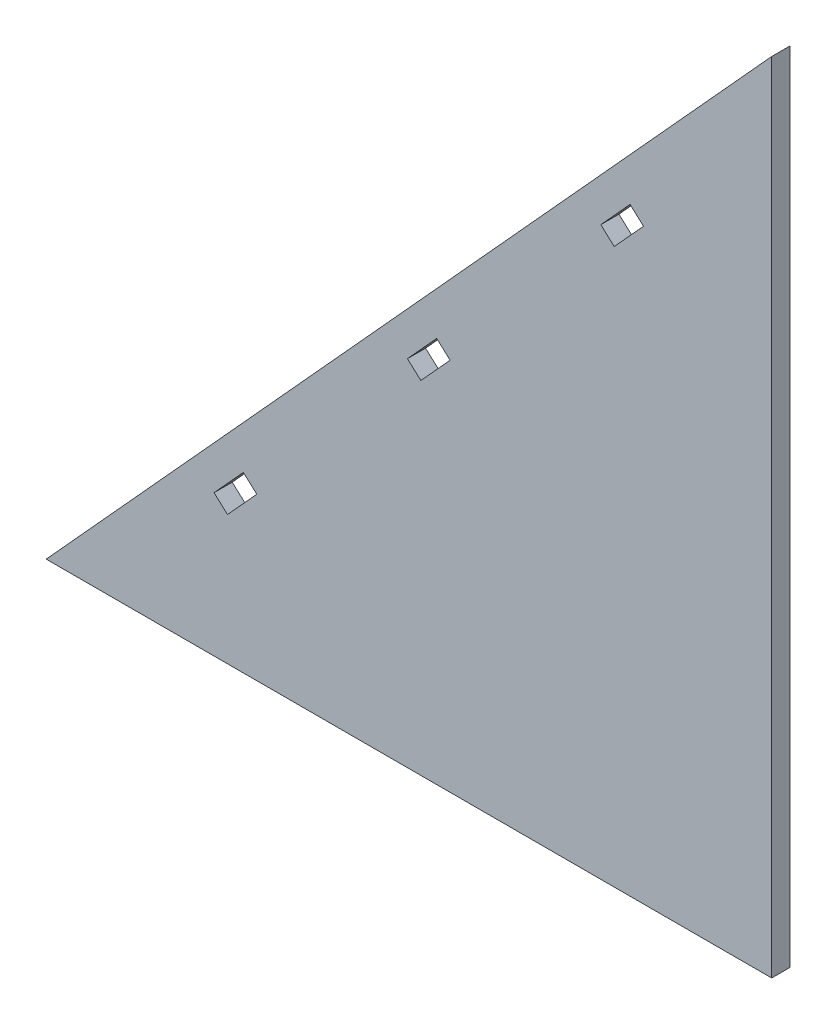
ISO-10303-21;
HEADER;
FILE_DESCRIPTION(('STEP AP214'),'2;1');
FILE_NAME('part.step','',(''),(''),'','','');
FILE_SCHEMA(('AUTOMOTIVE_DESIGN { 1 0 10303 214 1 1 1 1 }'));
ENDSEC;
DATA;
#1=APPLICATION_CONTEXT('core data for automotive mechanical design processes');
#2=APPLICATION_PROTOCOL_DEFINITION('international standard','automotive_design',2000,#1);
#3=PRODUCT_CONTEXT('',#1,'mechanical');
#4=PRODUCT('Part','Part','',(#3));
#5=PRODUCT_RELATED_PRODUCT_CATEGORY('part','',(#4));
#6=PRODUCT_DEFINITION_FORMATION('','',#4);
#7=PRODUCT_DEFINITION_CONTEXT('part definition',#1,'design');
#8=PRODUCT_DEFINITION('design','',#6,#7);
#9=PRODUCT_DEFINITION_SHAPE('','',#8);
#10=(LENGTH_UNIT() NAMED_UNIT(*) SI_UNIT(.MILLI.,.METRE.));
#11=(NAMED_UNIT(*) PLANE_ANGLE_UNIT() SI_UNIT($,.RADIAN.));
#12=(NAMED_UNIT(*) SI_UNIT($,.STERADIAN.) SOLID_ANGLE_UNIT());
#13=UNCERTAINTY_MEASURE_WITH_UNIT(LENGTH_MEASURE(1.E-05),#10,'distance_accuracy_value','');
#14=(GEOMETRIC_REPRESENTATION_CONTEXT(3) GLOBAL_UNCERTAINTY_ASSIGNED_CONTEXT((#13)) GLOBAL_UNIT_ASSIGNED_CONTEXT((#10,
#11,#12)) REPRESENTATION_CONTEXT('',''));
#15=CARTESIAN_POINT('',(0.,0.,0.));
#16=DIRECTION('',(0.,0.,1.));
#17=DIRECTION('',(1.,0.,0.));
#18=AXIS2_PLACEMENT_3D('',#15,#16,#17);
#19=CARTESIAN_POINT('',(0.,0.,2.5));
#20=DIRECTION('',(0.,0.,1.));
#21=DIRECTION('',(1.,0.,0.));
#22=AXIS2_PLACEMENT_3D('',#19,#20,#21);
#23=PLANE('',#22);
#24=DIRECTION('',(-0.672672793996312,-0.739940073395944,0.));
#25=VECTOR('',#24,1.);
#26=CARTESIAN_POINT('',(99.2546760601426,97.8127892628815,2.5));
#27=LINE('',#26,#25);
#28=CARTESIAN_POINT('',(99.2546760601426,97.8127892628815,2.5));
#29=VERTEX_POINT('',#28);
#30=CARTESIAN_POINT('',(-0.745323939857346,-12.1872107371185,2.5));
#31=VERTEX_POINT('',#30);
#32=EDGE_CURVE('E240',#29,#31,#27,.T.);
#33=ORIENTED_EDGE('',*,*,#32,.T.);
#34=DIRECTION('',(1.,0.,0.));
#35=VECTOR('',#34,1.);
#36=CARTESIAN_POINT('',(-0.745323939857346,-12.1872107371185,2.5));
#37=LINE('',#36,#35);
#38=CARTESIAN_POINT('',(99.2546760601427,-12.1872107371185,2.5));
#39=VERTEX_POINT('',#38);
#40=EDGE_CURVE('E243',#31,#39,#37,.T.);
#41=ORIENTED_EDGE('',*,*,#40,.T.);
#42=DIRECTION('',(0.,1.,0.));
#43=VECTOR('',#42,1.);
#44=CARTESIAN_POINT('',(99.2546760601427,-12.1872107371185,2.5));
#45=LINE('',#44,#43);
#46=EDGE_CURVE('E246',#39,#29,#45,.T.);
#47=ORIENTED_EDGE('',*,*,#46,.T.);
#48=EDGE_LOOP('',(#33,#41,#47));
#49=FACE_BOUND('',#48,.T.);
#50=DIRECTION('',(0.672672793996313,0.739940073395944,0.));
#51=VECTOR('',#50,1.);
#52=CARTESIAN_POINT('',(77.5494150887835,64.2740575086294,2.5));
#53=LINE('',#52,#51);
#54=CARTESIAN_POINT('',(77.5494150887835,64.2740575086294,2.5));
#55=VERTEX_POINT('',#54);
#56=CARTESIAN_POINT('',(81.5854518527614,68.713697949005,2.5));
#57=VERTEX_POINT('',#56);
#58=EDGE_CURVE('E211',#55,#57,#53,.T.);
#59=ORIENTED_EDGE('',*,*,#58,.F.);
#60=DIRECTION('',(0.739940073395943,-0.672672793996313,0.));
#61=VECTOR('',#60,1.);
#62=CARTESIAN_POINT('',(75.6995649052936,65.9557394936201,2.5));
#63=LINE('',#62,#61);
#64=CARTESIAN_POINT('',(75.6995649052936,65.9557394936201,2.5));
#65=VERTEX_POINT('',#64);
#66=EDGE_CURVE('E209',#65,#55,#63,.T.);
#67=ORIENTED_EDGE('',*,*,#66,.F.);
#68=DIRECTION('',(-0.672672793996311,-0.739940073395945,0.));
#69=VECTOR('',#68,1.);
#70=CARTESIAN_POINT('',(75.6995649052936,65.9557394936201,2.5));
#71=LINE('',#70,#69);
#72=CARTESIAN_POINT('',(79.7356016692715,70.3953799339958,2.5));
#73=VERTEX_POINT('',#72);
#74=EDGE_CURVE('E217',#73,#65,#71,.T.);
#75=ORIENTED_EDGE('',*,*,#74,.F.);
#76=DIRECTION('',(-0.73994007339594,0.672672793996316,0.));
#77=VECTOR('',#76,1.);
#78=CARTESIAN_POINT('',(79.7356016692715,70.3953799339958,2.5));
#79=LINE('',#78,#77);
#80=EDGE_CURVE('E214',#57,#73,#79,.T.);
#81=ORIENTED_EDGE('',*,*,#80,.F.);
#82=EDGE_LOOP('',(#59,#67,#75,#81));
#83=FACE_BOUND('',#82,.T.);
#84=DIRECTION('',(0.672672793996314,0.739940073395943,0.));
#85=VECTOR('',#84,1.);
#86=CARTESIAN_POINT('',(50.8988303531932,34.9546218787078,2.5));
#87=LINE('',#86,#85);
#88=CARTESIAN_POINT('',(50.8988303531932,34.9546218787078,2.5));
#89=VERTEX_POINT('',#88);
#90=CARTESIAN_POINT('',(54.9348671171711,39.3942623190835,2.5));
#91=VERTEX_POINT('',#90);
#92=EDGE_CURVE('E180',#89,#91,#87,.T.);
#93=ORIENTED_EDGE('',*,*,#92,.F.);
#94=DIRECTION('',(0.739940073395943,-0.672672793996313,0.));
#95=VECTOR('',#94,1.);
#96=CARTESIAN_POINT('',(49.0489801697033,36.6363038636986,2.5));
#97=LINE('',#96,#95);
#98=CARTESIAN_POINT('',(49.0489801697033,36.6363038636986,2.5));
#99=VERTEX_POINT('',#98);
#100=EDGE_CURVE('E178',#99,#89,#97,.T.);
#101=ORIENTED_EDGE('',*,*,#100,.F.);
#102=DIRECTION('',(-0.672672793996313,-0.739940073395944,0.));
#103=VECTOR('',#102,1.);
#104=CARTESIAN_POINT('',(49.0489801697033,36.6363038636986,2.5));
#105=LINE('',#104,#103);
#106=CARTESIAN_POINT('',(53.0850169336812,41.0759443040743,2.5));
#107=VERTEX_POINT('',#106);
#108=EDGE_CURVE('E186',#107,#99,#105,.T.);
#109=ORIENTED_EDGE('',*,*,#108,.F.);
#110=DIRECTION('',(-0.739940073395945,0.672672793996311,0.));
#111=VECTOR('',#110,1.);
#112=CARTESIAN_POINT('',(53.0850169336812,41.0759443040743,2.5));
#113=LINE('',#112,#111);
#114=EDGE_CURVE('E183',#91,#107,#113,.T.);
#115=ORIENTED_EDGE('',*,*,#114,.F.);
#116=EDGE_LOOP('',(#93,#101,#109,#115));
#117=FACE_BOUND('',#116,.T.);
#118=DIRECTION('',(0.672672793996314,0.739940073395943,0.));
#119=VECTOR('',#118,1.);
#120=CARTESIAN_POINT('',(24.2482456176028,5.6351862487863,2.5));
#121=LINE('',#120,#119);
#122=CARTESIAN_POINT('',(24.2482456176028,5.6351862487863,2.5));
#123=VERTEX_POINT('',#122);
#124=CARTESIAN_POINT('',(28.2842823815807,10.074826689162,2.5));
#125=VERTEX_POINT('',#124);
#126=EDGE_CURVE('E150',#123,#125,#121,.T.);
#127=ORIENTED_EDGE('',*,*,#126,.F.);
#128=DIRECTION('',(0.739940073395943,-0.672672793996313,0.));
#129=VECTOR('',#128,1.);
#130=CARTESIAN_POINT('',(22.398395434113,7.31686823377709,2.5));
#131=LINE('',#130,#129);
#132=CARTESIAN_POINT('',(22.398395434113,7.31686823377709,2.5));
#133=VERTEX_POINT('',#132);
#134=EDGE_CURVE('E142',#133,#123,#131,.T.);
#135=ORIENTED_EDGE('',*,*,#134,.F.);
#136=DIRECTION('',(-0.672672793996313,-0.739940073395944,0.));
#137=VECTOR('',#136,1.);
#138=CARTESIAN_POINT('',(22.398395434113,7.31686823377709,2.5));
#139=LINE('',#138,#137);
#140=CARTESIAN_POINT('',(26.4344321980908,11.7565086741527,2.5));
#141=VERTEX_POINT('',#140);
#142=EDGE_CURVE('E164',#141,#133,#139,.T.);
#143=ORIENTED_EDGE('',*,*,#142,.F.);
#144=DIRECTION('',(-0.739940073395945,0.672672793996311,0.));
#145=VECTOR('',#144,1.);
#146=CARTESIAN_POINT('',(26.4344321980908,11.7565086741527,2.5));
#147=LINE('',#146,#145);
#148=EDGE_CURVE('E162',#125,#141,#147,.T.);
#149=ORIENTED_EDGE('',*,*,#148,.F.);
#150=EDGE_LOOP('',(#127,#135,#143,#149));
#151=FACE_BOUND('',#150,.T.);
#152=ADVANCED_FACE('F35',(#49,#83,#117,#151),#23,.T.);
#153=CARTESIAN_POINT('',(0.,0.,0.));
#154=DIRECTION('',(0.,0.,1.));
#155=DIRECTION('',(1.,0.,0.));
#156=AXIS2_PLACEMENT_3D('',#153,#154,#155);
#157=PLANE('',#156);
#158=DIRECTION('',(0.739940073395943,-0.672672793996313,0.));
#159=VECTOR('',#158,1.);
#160=CARTESIAN_POINT('',(49.0489801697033,36.6363038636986,0.));
#161=LINE('',#160,#159);
#162=CARTESIAN_POINT('',(49.0489801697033,36.6363038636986,0.));
#163=VERTEX_POINT('',#162);
#164=CARTESIAN_POINT('',(50.8988303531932,34.9546218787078,0.));
#165=VERTEX_POINT('',#164);
#166=EDGE_CURVE('E158',#163,#165,#161,.T.);
#167=ORIENTED_EDGE('',*,*,#166,.T.);
#168=DIRECTION('',(0.672672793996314,0.739940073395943,0.));
#169=VECTOR('',#168,1.);
#170=CARTESIAN_POINT('',(50.8988303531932,34.9546218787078,0.));
#171=LINE('',#170,#169);
#172=CARTESIAN_POINT('',(54.9348671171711,39.3942623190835,0.));
#173=VERTEX_POINT('',#172);
#174=EDGE_CURVE('E191',#165,#173,#171,.T.);
#175=ORIENTED_EDGE('',*,*,#174,.T.);
#176=DIRECTION('',(-0.739940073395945,0.672672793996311,0.));
#177=VECTOR('',#176,1.);
#178=CARTESIAN_POINT('',(53.0850169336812,41.0759443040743,0.));
#179=LINE('',#178,#177);
#180=CARTESIAN_POINT('',(53.0850169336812,41.0759443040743,0.));
#181=VERTEX_POINT('',#180);
#182=EDGE_CURVE('E194',#173,#181,#179,.T.);
#183=ORIENTED_EDGE('',*,*,#182,.T.);
#184=DIRECTION('',(-0.672672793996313,-0.739940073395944,0.));
#185=VECTOR('',#184,1.);
#186=CARTESIAN_POINT('',(49.0489801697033,36.6363038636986,0.));
#187=LINE('',#186,#185);
#188=EDGE_CURVE('E181',#181,#163,#187,.T.);
#189=ORIENTED_EDGE('',*,*,#188,.T.);
#190=EDGE_LOOP('',(#167,#175,#183,#189));
#191=FACE_BOUND('',#190,.T.);
#192=DIRECTION('',(-0.672672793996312,-0.739940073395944,0.));
#193=VECTOR('',#192,1.);
#194=CARTESIAN_POINT('',(99.2546760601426,97.8127892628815,0.));
#195=LINE('',#194,#193);
#196=CARTESIAN_POINT('',(99.2546760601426,97.8127892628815,0.));
#197=VERTEX_POINT('',#196);
#198=CARTESIAN_POINT('',(-0.745323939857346,-12.1872107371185,0.));
#199=VERTEX_POINT('',#198);
#200=EDGE_CURVE('E239',#197,#199,#195,.T.);
#201=ORIENTED_EDGE('',*,*,#200,.F.);
#202=DIRECTION('',(0.,1.,0.));
#203=VECTOR('',#202,1.);
#204=CARTESIAN_POINT('',(99.2546760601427,-12.1872107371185,0.));
#205=LINE('',#204,#203);
#206=CARTESIAN_POINT('',(99.2546760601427,-12.1872107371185,0.));
#207=VERTEX_POINT('',#206);
#208=EDGE_CURVE('E244',#207,#197,#205,.T.);
#209=ORIENTED_EDGE('',*,*,#208,.F.);
#210=DIRECTION('',(1.,0.,0.));
#211=VECTOR('',#210,1.);
#212=CARTESIAN_POINT('',(-0.745323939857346,-12.1872107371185,0.));
#213=LINE('',#212,#211);
#214=EDGE_CURVE('E251',#199,#207,#213,.T.);
#215=ORIENTED_EDGE('',*,*,#214,.F.);
#216=EDGE_LOOP('',(#201,#209,#215));
#217=FACE_BOUND('',#216,.T.);
#218=DIRECTION('',(0.739940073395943,-0.672672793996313,0.));
#219=VECTOR('',#218,1.);
#220=CARTESIAN_POINT('',(75.6995649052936,65.9557394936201,0.));
#221=LINE('',#220,#219);
#222=CARTESIAN_POINT('',(75.6995649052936,65.9557394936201,0.));
#223=VERTEX_POINT('',#222);
#224=CARTESIAN_POINT('',(77.5494150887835,64.2740575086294,0.));
#225=VERTEX_POINT('',#224);
#226=EDGE_CURVE('E208',#223,#225,#221,.T.);
#227=ORIENTED_EDGE('',*,*,#226,.T.);
#228=DIRECTION('',(0.672672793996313,0.739940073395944,0.));
#229=VECTOR('',#228,1.);
#230=CARTESIAN_POINT('',(77.5494150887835,64.2740575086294,0.));
#231=LINE('',#230,#229);
#232=CARTESIAN_POINT('',(81.5854518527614,68.713697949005,0.));
#233=VERTEX_POINT('',#232);
#234=EDGE_CURVE('E222',#225,#233,#231,.T.);
#235=ORIENTED_EDGE('',*,*,#234,.T.);
#236=DIRECTION('',(-0.73994007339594,0.672672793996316,0.));
#237=VECTOR('',#236,1.);
#238=CARTESIAN_POINT('',(79.7356016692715,70.3953799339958,0.));
#239=LINE('',#238,#237);
#240=CARTESIAN_POINT('',(79.7356016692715,70.3953799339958,0.));
#241=VERTEX_POINT('',#240);
#242=EDGE_CURVE('E225',#233,#241,#239,.T.);
#243=ORIENTED_EDGE('',*,*,#242,.T.);
#244=DIRECTION('',(-0.672672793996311,-0.739940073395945,0.));
#245=VECTOR('',#244,1.);
#246=CARTESIAN_POINT('',(75.6995649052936,65.9557394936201,0.));
#247=LINE('',#246,#245);
#248=EDGE_CURVE('E212',#241,#223,#247,.T.);
#249=ORIENTED_EDGE('',*,*,#248,.T.);
#250=EDGE_LOOP('',(#227,#235,#243,#249));
#251=FACE_BOUND('',#250,.T.);
#252=DIRECTION('',(0.739940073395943,-0.672672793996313,0.));
#253=VECTOR('',#252,1.);
#254=CARTESIAN_POINT('',(22.398395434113,7.31686823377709,0.));
#255=LINE('',#254,#253);
#256=CARTESIAN_POINT('',(22.398395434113,7.31686823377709,0.));
#257=VERTEX_POINT('',#256);
#258=CARTESIAN_POINT('',(24.2482456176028,5.6351862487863,0.));
#259=VERTEX_POINT('',#258);
#260=EDGE_CURVE('E58',#257,#259,#255,.T.);
#261=ORIENTED_EDGE('',*,*,#260,.T.);
#262=DIRECTION('',(0.672672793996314,0.739940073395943,0.));
#263=VECTOR('',#262,1.);
#264=CARTESIAN_POINT('',(24.2482456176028,5.6351862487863,0.));
#265=LINE('',#264,#263);
#266=CARTESIAN_POINT('',(28.2842823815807,10.074826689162,0.));
#267=VERTEX_POINT('',#266);
#268=EDGE_CURVE('E157',#259,#267,#265,.T.);
#269=ORIENTED_EDGE('',*,*,#268,.T.);
#270=DIRECTION('',(-0.739940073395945,0.672672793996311,0.));
#271=VECTOR('',#270,1.);
#272=CARTESIAN_POINT('',(26.4344321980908,11.7565086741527,0.));
#273=LINE('',#272,#271);
#274=CARTESIAN_POINT('',(26.4344321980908,11.7565086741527,0.));
#275=VERTEX_POINT('',#274);
#276=EDGE_CURVE('E170',#267,#275,#273,.T.);
#277=ORIENTED_EDGE('',*,*,#276,.T.);
#278=DIRECTION('',(-0.672672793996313,-0.739940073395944,0.));
#279=VECTOR('',#278,1.);
#280=CARTESIAN_POINT('',(22.398395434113,7.31686823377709,0.));
#281=LINE('',#280,#279);
#282=EDGE_CURVE('E151',#275,#257,#281,.T.);
#283=ORIENTED_EDGE('',*,*,#282,.T.);
#284=EDGE_LOOP('',(#261,#269,#277,#283));
#285=FACE_BOUND('',#284,.T.);
#286=ADVANCED_FACE('F265',(#191,#217,#251,#285),#157,.F.);
#287=CARTESIAN_POINT('',(99.2546760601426,97.8127892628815,2.5));
#288=DIRECTION('',(0.739940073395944,-0.672672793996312,0.));
#289=DIRECTION('',(0.672672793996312,0.739940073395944,0.));
#290=AXIS2_PLACEMENT_3D('',#287,#288,#289);
#291=PLANE('',#290);
#292=ORIENTED_EDGE('',*,*,#200,.T.);
#293=DIRECTION('',(0.,0.,-1.));
#294=VECTOR('',#293,1.);
#295=CARTESIAN_POINT('',(-0.745323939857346,-12.1872107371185,2.5));
#296=LINE('',#295,#294);
#297=EDGE_CURVE('E11',#31,#199,#296,.T.);
#298=ORIENTED_EDGE('',*,*,#297,.F.);
#299=ORIENTED_EDGE('',*,*,#32,.F.);
#300=DIRECTION('',(0.,0.,-1.));
#301=VECTOR('',#300,1.);
#302=CARTESIAN_POINT('',(99.2546760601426,97.8127892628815,2.5));
#303=LINE('',#302,#301);
#304=EDGE_CURVE('E248',#29,#197,#303,.T.);
#305=ORIENTED_EDGE('',*,*,#304,.T.);
#306=EDGE_LOOP('',(#292,#298,#299,#305));
#307=FACE_BOUND('',#306,.T.);
#308=ADVANCED_FACE('F37',(#307),#291,.F.);
#309=CARTESIAN_POINT('',(-0.745323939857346,-12.1872107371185,2.5));
#310=DIRECTION('',(0.,1.,0.));
#311=DIRECTION('',(-1.,0.,0.));
#312=AXIS2_PLACEMENT_3D('',#309,#310,#311);
#313=PLANE('',#312);
#314=ORIENTED_EDGE('',*,*,#214,.T.);
#315=DIRECTION('',(0.,0.,-1.));
#316=VECTOR('',#315,1.);
#317=CARTESIAN_POINT('',(99.2546760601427,-12.1872107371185,2.5));
#318=LINE('',#317,#316);
#319=EDGE_CURVE('E43',#39,#207,#318,.T.);
#320=ORIENTED_EDGE('',*,*,#319,.F.);
#321=ORIENTED_EDGE('',*,*,#40,.F.);
#322=ORIENTED_EDGE('',*,*,#297,.T.);
#323=EDGE_LOOP('',(#314,#320,#321,#322));
#324=FACE_BOUND('',#323,.T.);
#325=ADVANCED_FACE('F272',(#324),#313,.F.);
#326=CARTESIAN_POINT('',(99.2546760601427,-12.1872107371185,2.5));
#327=DIRECTION('',(-1.,0.,0.));
#328=DIRECTION('',(0.,-1.,0.));
#329=AXIS2_PLACEMENT_3D('',#326,#327,#328);
#330=PLANE('',#329);
#331=ORIENTED_EDGE('',*,*,#208,.T.);
#332=ORIENTED_EDGE('',*,*,#304,.F.);
#333=ORIENTED_EDGE('',*,*,#46,.F.);
#334=ORIENTED_EDGE('',*,*,#319,.T.);
#335=EDGE_LOOP('',(#331,#332,#333,#334));
#336=FACE_BOUND('',#335,.T.);
#337=ADVANCED_FACE('F260',(#336),#330,.F.);
#338=CARTESIAN_POINT('',(75.6995649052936,65.9557394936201,2.5));
#339=DIRECTION('',(0.672672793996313,0.739940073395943,0.));
#340=DIRECTION('',(-0.739940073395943,0.672672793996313,0.));
#341=AXIS2_PLACEMENT_3D('',#338,#339,#340);
#342=PLANE('',#341);
#343=ORIENTED_EDGE('',*,*,#226,.F.);
#344=DIRECTION('',(0.,0.,-1.));
#345=VECTOR('',#344,1.);
#346=CARTESIAN_POINT('',(75.6995649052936,65.9557394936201,2.5));
#347=LINE('',#346,#345);
#348=EDGE_CURVE('E219',#65,#223,#347,.T.);
#349=ORIENTED_EDGE('',*,*,#348,.F.);
#350=ORIENTED_EDGE('',*,*,#66,.T.);
#351=DIRECTION('',(0.,0.,-1.));
#352=VECTOR('',#351,1.);
#353=CARTESIAN_POINT('',(77.5494150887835,64.2740575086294,2.5));
#354=LINE('',#353,#352);
#355=EDGE_CURVE('E236',#55,#225,#354,.T.);
#356=ORIENTED_EDGE('',*,*,#355,.T.);
#357=EDGE_LOOP('',(#343,#349,#350,#356));
#358=FACE_BOUND('',#357,.T.);
#359=ADVANCED_FACE('F278',(#358),#342,.T.);
#360=CARTESIAN_POINT('',(77.5494150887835,64.2740575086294,2.5));
#361=DIRECTION('',(-0.739940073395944,0.672672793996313,0.));
#362=DIRECTION('',(-0.672672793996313,-0.739940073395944,0.));
#363=AXIS2_PLACEMENT_3D('',#360,#361,#362);
#364=PLANE('',#363);
#365=ORIENTED_EDGE('',*,*,#234,.F.);
#366=ORIENTED_EDGE('',*,*,#355,.F.);
#367=ORIENTED_EDGE('',*,*,#58,.T.);
#368=DIRECTION('',(0.,0.,-1.));
#369=VECTOR('',#368,1.);
#370=CARTESIAN_POINT('',(81.5854518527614,68.713697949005,2.5));
#371=LINE('',#370,#369);
#372=EDGE_CURVE('E234',#57,#233,#371,.T.);
#373=ORIENTED_EDGE('',*,*,#372,.T.);
#374=EDGE_LOOP('',(#365,#366,#367,#373));
#375=FACE_BOUND('',#374,.T.);
#376=ADVANCED_FACE('F290',(#375),#364,.T.);
#377=CARTESIAN_POINT('',(79.7356016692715,70.3953799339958,2.5));
#378=DIRECTION('',(-0.672672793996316,-0.73994007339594,0.));
#379=DIRECTION('',(0.73994007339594,-0.672672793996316,0.));
#380=AXIS2_PLACEMENT_3D('',#377,#378,#379);
#381=PLANE('',#380);
#382=ORIENTED_EDGE('',*,*,#242,.F.);
#383=ORIENTED_EDGE('',*,*,#372,.F.);
#384=ORIENTED_EDGE('',*,*,#80,.T.);
#385=DIRECTION('',(0.,0.,-1.));
#386=VECTOR('',#385,1.);
#387=CARTESIAN_POINT('',(79.7356016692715,70.3953799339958,2.5));
#388=LINE('',#387,#386);
#389=EDGE_CURVE('E232',#73,#241,#388,.T.);
#390=ORIENTED_EDGE('',*,*,#389,.T.);
#391=EDGE_LOOP('',(#382,#383,#384,#390));
#392=FACE_BOUND('',#391,.T.);
#393=ADVANCED_FACE('F294',(#392),#381,.T.);
#394=CARTESIAN_POINT('',(75.6995649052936,65.9557394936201,2.5));
#395=DIRECTION('',(0.739940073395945,-0.672672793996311,0.));
#396=DIRECTION('',(0.672672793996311,0.739940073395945,0.));
#397=AXIS2_PLACEMENT_3D('',#394,#395,#396);
#398=PLANE('',#397);
#399=ORIENTED_EDGE('',*,*,#248,.F.);
#400=ORIENTED_EDGE('',*,*,#389,.F.);
#401=ORIENTED_EDGE('',*,*,#74,.T.);
#402=ORIENTED_EDGE('',*,*,#348,.T.);
#403=EDGE_LOOP('',(#399,#400,#401,#402));
#404=FACE_BOUND('',#403,.T.);
#405=ADVANCED_FACE('F298',(#404),#398,.T.);
#406=CARTESIAN_POINT('',(49.0489801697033,36.6363038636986,2.5));
#407=DIRECTION('',(0.672672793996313,0.739940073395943,0.));
#408=DIRECTION('',(-0.739940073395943,0.672672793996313,0.));
#409=AXIS2_PLACEMENT_3D('',#406,#407,#408);
#410=PLANE('',#409);
#411=ORIENTED_EDGE('',*,*,#166,.F.);
#412=DIRECTION('',(0.,0.,-1.));
#413=VECTOR('',#412,1.);
#414=CARTESIAN_POINT('',(49.0489801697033,36.6363038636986,2.5));
#415=LINE('',#414,#413);
#416=EDGE_CURVE('E188',#99,#163,#415,.T.);
#417=ORIENTED_EDGE('',*,*,#416,.F.);
#418=ORIENTED_EDGE('',*,*,#100,.T.);
#419=DIRECTION('',(0.,0.,-1.));
#420=VECTOR('',#419,1.);
#421=CARTESIAN_POINT('',(50.8988303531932,34.9546218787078,2.5));
#422=LINE('',#421,#420);
#423=EDGE_CURVE('E205',#89,#165,#422,.T.);
#424=ORIENTED_EDGE('',*,*,#423,.T.);
#425=EDGE_LOOP('',(#411,#417,#418,#424));
#426=FACE_BOUND('',#425,.T.);
#427=ADVANCED_FACE('F302',(#426),#410,.T.);
#428=CARTESIAN_POINT('',(50.8988303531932,34.9546218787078,2.5));
#429=DIRECTION('',(-0.739940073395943,0.672672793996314,0.));
#430=DIRECTION('',(-0.672672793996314,-0.739940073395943,0.));
#431=AXIS2_PLACEMENT_3D('',#428,#429,#430);
#432=PLANE('',#431);
#433=ORIENTED_EDGE('',*,*,#174,.F.);
#434=ORIENTED_EDGE('',*,*,#423,.F.);
#435=ORIENTED_EDGE('',*,*,#92,.T.);
#436=DIRECTION('',(0.,0.,-1.));
#437=VECTOR('',#436,1.);
#438=CARTESIAN_POINT('',(54.9348671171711,39.3942623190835,2.5));
#439=LINE('',#438,#437);
#440=EDGE_CURVE('E203',#91,#173,#439,.T.);
#441=ORIENTED_EDGE('',*,*,#440,.T.);
#442=EDGE_LOOP('',(#433,#434,#435,#441));
#443=FACE_BOUND('',#442,.T.);
#444=ADVANCED_FACE('F306',(#443),#432,.T.);
#445=CARTESIAN_POINT('',(53.0850169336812,41.0759443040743,2.5));
#446=DIRECTION('',(-0.672672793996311,-0.739940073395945,0.));
#447=DIRECTION('',(0.739940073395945,-0.672672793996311,0.));
#448=AXIS2_PLACEMENT_3D('',#445,#446,#447);
#449=PLANE('',#448);
#450=ORIENTED_EDGE('',*,*,#182,.F.);
#451=ORIENTED_EDGE('',*,*,#440,.F.);
#452=ORIENTED_EDGE('',*,*,#114,.T.);
#453=DIRECTION('',(0.,0.,-1.));
#454=VECTOR('',#453,1.);
#455=CARTESIAN_POINT('',(53.0850169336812,41.0759443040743,2.5));
#456=LINE('',#455,#454);
#457=EDGE_CURVE('E201',#107,#181,#456,.T.);
#458=ORIENTED_EDGE('',*,*,#457,.T.);
#459=EDGE_LOOP('',(#450,#451,#452,#458));
#460=FACE_BOUND('',#459,.T.);
#461=ADVANCED_FACE('F310',(#460),#449,.T.);
#462=CARTESIAN_POINT('',(49.0489801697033,36.6363038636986,2.5));
#463=DIRECTION('',(0.739940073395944,-0.672672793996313,0.));
#464=DIRECTION('',(0.672672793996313,0.739940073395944,0.));
#465=AXIS2_PLACEMENT_3D('',#462,#463,#464);
#466=PLANE('',#465);
#467=ORIENTED_EDGE('',*,*,#188,.F.);
#468=ORIENTED_EDGE('',*,*,#457,.F.);
#469=ORIENTED_EDGE('',*,*,#108,.T.);
#470=ORIENTED_EDGE('',*,*,#416,.T.);
#471=EDGE_LOOP('',(#467,#468,#469,#470));
#472=FACE_BOUND('',#471,.T.);
#473=ADVANCED_FACE('F314',(#472),#466,.T.);
#474=CARTESIAN_POINT('',(22.398395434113,7.31686823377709,2.5));
#475=DIRECTION('',(0.672672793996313,0.739940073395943,0.));
#476=DIRECTION('',(-0.739940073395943,0.672672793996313,0.));
#477=AXIS2_PLACEMENT_3D('',#474,#475,#476);
#478=PLANE('',#477);
#479=ORIENTED_EDGE('',*,*,#260,.F.);
#480=DIRECTION('',(0.,0.,-1.));
#481=VECTOR('',#480,1.);
#482=CARTESIAN_POINT('',(22.398395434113,7.31686823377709,2.5));
#483=LINE('',#482,#481);
#484=EDGE_CURVE('E146',#133,#257,#483,.T.);
#485=ORIENTED_EDGE('',*,*,#484,.F.);
#486=ORIENTED_EDGE('',*,*,#134,.T.);
#487=DIRECTION('',(0.,0.,-1.));
#488=VECTOR('',#487,1.);
#489=CARTESIAN_POINT('',(24.2482456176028,5.6351862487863,2.5));
#490=LINE('',#489,#488);
#491=EDGE_CURVE('E145',#123,#259,#490,.T.);
#492=ORIENTED_EDGE('',*,*,#491,.T.);
#493=EDGE_LOOP('',(#479,#485,#486,#492));
#494=FACE_BOUND('',#493,.T.);
#495=ADVANCED_FACE('F144',(#494),#478,.T.);
#496=CARTESIAN_POINT('',(24.2482456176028,5.6351862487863,2.5));
#497=DIRECTION('',(-0.739940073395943,0.672672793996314,0.));
#498=DIRECTION('',(-0.672672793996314,-0.739940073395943,0.));
#499=AXIS2_PLACEMENT_3D('',#496,#497,#498);
#500=PLANE('',#499);
#501=ORIENTED_EDGE('',*,*,#268,.F.);
#502=ORIENTED_EDGE('',*,*,#491,.F.);
#503=ORIENTED_EDGE('',*,*,#126,.T.);
#504=DIRECTION('',(0.,0.,-1.));
#505=VECTOR('',#504,1.);
#506=CARTESIAN_POINT('',(28.2842823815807,10.074826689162,2.5));
#507=LINE('',#506,#505);
#508=EDGE_CURVE('E159',#125,#267,#507,.T.);
#509=ORIENTED_EDGE('',*,*,#508,.T.);
#510=EDGE_LOOP('',(#501,#502,#503,#509));
#511=FACE_BOUND('',#510,.T.);
#512=ADVANCED_FACE('F154',(#511),#500,.T.);
#513=CARTESIAN_POINT('',(26.4344321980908,11.7565086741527,2.5));
#514=DIRECTION('',(-0.672672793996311,-0.739940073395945,0.));
#515=DIRECTION('',(0.739940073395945,-0.672672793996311,0.));
#516=AXIS2_PLACEMENT_3D('',#513,#514,#515);
#517=PLANE('',#516);
#518=ORIENTED_EDGE('',*,*,#276,.F.);
#519=ORIENTED_EDGE('',*,*,#508,.F.);
#520=ORIENTED_EDGE('',*,*,#148,.T.);
#521=DIRECTION('',(0.,0.,-1.));
#522=VECTOR('',#521,1.);
#523=CARTESIAN_POINT('',(26.4344321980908,11.7565086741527,2.5));
#524=LINE('',#523,#522);
#525=EDGE_CURVE('E50',#141,#275,#524,.T.);
#526=ORIENTED_EDGE('',*,*,#525,.T.);
#527=EDGE_LOOP('',(#518,#519,#520,#526));
#528=FACE_BOUND('',#527,.T.);
#529=ADVANCED_FACE('F323',(#528),#517,.T.);
#530=CARTESIAN_POINT('',(22.398395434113,7.31686823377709,2.5));
#531=DIRECTION('',(0.739940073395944,-0.672672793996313,0.));
#532=DIRECTION('',(0.672672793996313,0.739940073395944,0.));
#533=AXIS2_PLACEMENT_3D('',#530,#531,#532);
#534=PLANE('',#533);
#535=ORIENTED_EDGE('',*,*,#282,.F.);
#536=ORIENTED_EDGE('',*,*,#525,.F.);
#537=ORIENTED_EDGE('',*,*,#142,.T.);
#538=ORIENTED_EDGE('',*,*,#484,.T.);
#539=EDGE_LOOP('',(#535,#536,#537,#538));
#540=FACE_BOUND('',#539,.T.);
#541=ADVANCED_FACE('F326',(#540),#534,.T.);
#542=CLOSED_SHELL('',(#152,#286,#308,#325,#337,#359,#376,#393,#405,#427,#444,#461,#473,#495,
#512,#529,#541));
#543=MANIFOLD_SOLID_BREP('B2',#542);
#544=ADVANCED_BREP_SHAPE_REPRESENTATION('',(#18,#543),#14);
#545=SHAPE_DEFINITION_REPRESENTATION(#9,#544);
ENDSEC;
END-ISO-10303-21;
